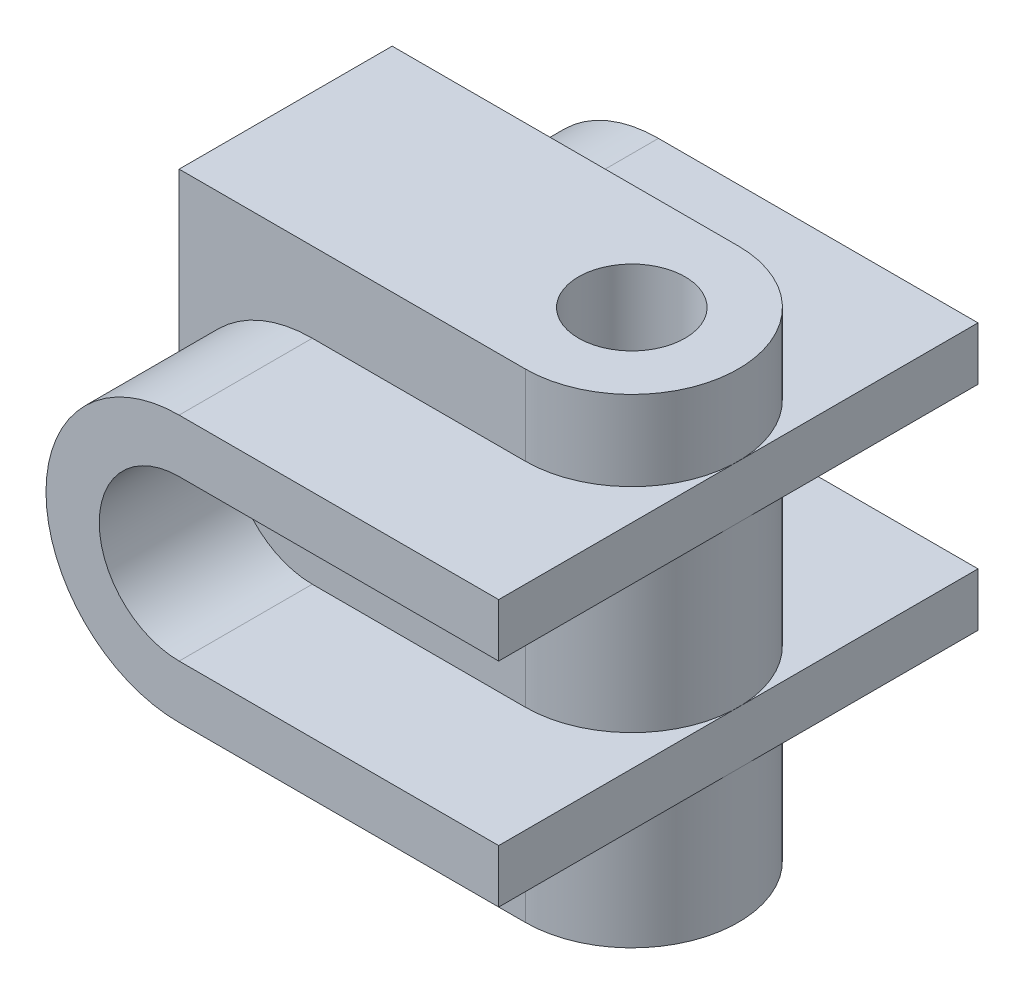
ISO-10303-21;
HEADER;
FILE_DESCRIPTION(('STEP AP214'),'2;1');
FILE_NAME('part.step','',(''),(''),'','','');
FILE_SCHEMA(('AUTOMOTIVE_DESIGN { 1 0 10303 214 1 1 1 1 }'));
ENDSEC;
DATA;
#1=APPLICATION_CONTEXT('core data for automotive mechanical design processes');
#2=APPLICATION_PROTOCOL_DEFINITION('international standard','automotive_design',2000,#1);
#3=PRODUCT_CONTEXT('',#1,'mechanical');
#4=PRODUCT('Part','Part','',(#3));
#5=PRODUCT_RELATED_PRODUCT_CATEGORY('part','',(#4));
#6=PRODUCT_DEFINITION_FORMATION('','',#4);
#7=PRODUCT_DEFINITION_CONTEXT('part definition',#1,'design');
#8=PRODUCT_DEFINITION('design','',#6,#7);
#9=PRODUCT_DEFINITION_SHAPE('','',#8);
#10=(LENGTH_UNIT() NAMED_UNIT(*) SI_UNIT(.MILLI.,.METRE.));
#11=(NAMED_UNIT(*) PLANE_ANGLE_UNIT() SI_UNIT($,.RADIAN.));
#12=(NAMED_UNIT(*) SI_UNIT($,.STERADIAN.) SOLID_ANGLE_UNIT());
#13=UNCERTAINTY_MEASURE_WITH_UNIT(LENGTH_MEASURE(1.E-05),#10,'distance_accuracy_value','');
#14=(GEOMETRIC_REPRESENTATION_CONTEXT(3) GLOBAL_UNCERTAINTY_ASSIGNED_CONTEXT((#13)) GLOBAL_UNIT_ASSIGNED_CONTEXT((#10,
#11,#12)) REPRESENTATION_CONTEXT('',''));
#15=CARTESIAN_POINT('',(0.,0.,0.));
#16=DIRECTION('',(0.,0.,1.));
#17=DIRECTION('',(1.,0.,0.));
#18=AXIS2_PLACEMENT_3D('',#15,#16,#17);
#19=CARTESIAN_POINT('',(-20.,-90.,25.));
#20=DIRECTION('',(0.,0.,-1.));
#21=DIRECTION('',(-1.,0.,0.));
#22=AXIS2_PLACEMENT_3D('',#19,#20,#21);
#23=PLANE('',#22);
#24=DIRECTION('',(-1.,0.,0.));
#25=VECTOR('',#24,1.);
#26=CARTESIAN_POINT('',(-20.,0.,25.));
#27=LINE('',#26,#25);
#28=CARTESIAN_POINT('',(-20.,0.,25.));
#29=VERTEX_POINT('',#28);
#30=CARTESIAN_POINT('',(-85.,0.,25.));
#31=VERTEX_POINT('',#30);
#32=EDGE_CURVE('E84',#29,#31,#27,.T.);
#33=ORIENTED_EDGE('',*,*,#32,.F.);
#34=DIRECTION('',(0.,1.,0.));
#35=VECTOR('',#34,1.);
#36=CARTESIAN_POINT('',(-20.,-90.,25.));
#37=LINE('',#36,#35);
#38=CARTESIAN_POINT('',(-20.,-90.,25.));
#39=VERTEX_POINT('',#38);
#40=EDGE_CURVE('E12',#39,#29,#37,.T.);
#41=ORIENTED_EDGE('',*,*,#40,.F.);
#42=DIRECTION('',(-1.,0.,0.));
#43=VECTOR('',#42,1.);
#44=CARTESIAN_POINT('',(-20.,-90.,25.));
#45=LINE('',#44,#43);
#46=CARTESIAN_POINT('',(-85.,-90.,25.));
#47=VERTEX_POINT('',#46);
#48=EDGE_CURVE('E86',#39,#47,#45,.T.);
#49=ORIENTED_EDGE('',*,*,#48,.T.);
#50=DIRECTION('',(0.,1.,0.));
#51=VECTOR('',#50,1.);
#52=CARTESIAN_POINT('',(-85.,-90.,25.));
#53=LINE('',#52,#51);
#54=EDGE_CURVE('E47',#47,#31,#53,.T.);
#55=ORIENTED_EDGE('',*,*,#54,.T.);
#56=EDGE_LOOP('',(#33,#41,#49,#55));
#57=FACE_BOUND('',#56,.T.);
#58=ADVANCED_FACE('F44',(#57),#23,.T.);
#59=CARTESIAN_POINT('',(-20.,-90.,45.));
#60=DIRECTION('',(0.,1.,0.));
#61=DIRECTION('',(0.,0.,1.));
#62=AXIS2_PLACEMENT_3D('',#59,#60,#61);
#63=CYLINDRICAL_SURFACE('',#62,20.);
#64=CARTESIAN_POINT('',(-20.,0.,45.));
#65=DIRECTION('',(0.,1.,0.));
#66=DIRECTION('',(0.,0.,1.));
#67=AXIS2_PLACEMENT_3D('',#64,#65,#66);
#68=CIRCLE('',#67,20.);
#69=CARTESIAN_POINT('',(-20.,0.,65.));
#70=VERTEX_POINT('',#69);
#71=EDGE_CURVE('E101',#70,#29,#68,.T.);
#72=ORIENTED_EDGE('',*,*,#71,.F.);
#73=DIRECTION('',(0.,1.,0.));
#74=VECTOR('',#73,1.);
#75=CARTESIAN_POINT('',(-20.,-90.,65.));
#76=LINE('',#75,#74);
#77=CARTESIAN_POINT('',(-20.,-90.,65.));
#78=VERTEX_POINT('',#77);
#79=EDGE_CURVE('E52',#78,#70,#76,.T.);
#80=ORIENTED_EDGE('',*,*,#79,.F.);
#81=CARTESIAN_POINT('',(-20.,-90.,45.));
#82=DIRECTION('',(0.,1.,0.));
#83=DIRECTION('',(0.,0.,1.));
#84=AXIS2_PLACEMENT_3D('',#81,#82,#83);
#85=CIRCLE('',#84,20.);
#86=EDGE_CURVE('E91',#78,#39,#85,.T.);
#87=ORIENTED_EDGE('',*,*,#86,.T.);
#88=ORIENTED_EDGE('',*,*,#40,.T.);
#89=EDGE_LOOP('',(#72,#80,#87,#88));
#90=FACE_BOUND('',#89,.T.);
#91=ADVANCED_FACE('F121',(#90),#63,.T.);
#92=CARTESIAN_POINT('',(-85.,-90.,65.));
#93=DIRECTION('',(0.,0.,1.));
#94=DIRECTION('',(1.,0.,0.));
#95=AXIS2_PLACEMENT_3D('',#92,#93,#94);
#96=PLANE('',#95);
#97=DIRECTION('',(1.,0.,0.));
#98=VECTOR('',#97,1.);
#99=CARTESIAN_POINT('',(-85.,0.,65.));
#100=LINE('',#99,#98);
#101=CARTESIAN_POINT('',(-85.,0.,65.));
#102=VERTEX_POINT('',#101);
#103=EDGE_CURVE('E98',#102,#70,#100,.T.);
#104=ORIENTED_EDGE('',*,*,#103,.F.);
#105=DIRECTION('',(0.,1.,0.));
#106=VECTOR('',#105,1.);
#107=CARTESIAN_POINT('',(-85.,-90.,65.));
#108=LINE('',#107,#106);
#109=CARTESIAN_POINT('',(-85.,-90.,65.));
#110=VERTEX_POINT('',#109);
#111=EDGE_CURVE('E90',#110,#102,#108,.T.);
#112=ORIENTED_EDGE('',*,*,#111,.F.);
#113=DIRECTION('',(1.,0.,0.));
#114=VECTOR('',#113,1.);
#115=CARTESIAN_POINT('',(-85.,-90.,65.));
#116=LINE('',#115,#114);
#117=EDGE_CURVE('E114',#110,#78,#116,.T.);
#118=ORIENTED_EDGE('',*,*,#117,.T.);
#119=ORIENTED_EDGE('',*,*,#79,.T.);
#120=EDGE_LOOP('',(#104,#112,#118,#119));
#121=FACE_BOUND('',#120,.T.);
#122=ADVANCED_FACE('F118',(#121),#96,.T.);
#123=CARTESIAN_POINT('',(-85.,-90.,25.));
#124=DIRECTION('',(-1.,0.,0.));
#125=DIRECTION('',(0.,0.,1.));
#126=AXIS2_PLACEMENT_3D('',#123,#124,#125);
#127=PLANE('',#126);
#128=DIRECTION('',(0.,0.,1.));
#129=VECTOR('',#128,1.);
#130=CARTESIAN_POINT('',(-85.,0.,25.));
#131=LINE('',#130,#129);
#132=EDGE_CURVE('E93',#31,#102,#131,.T.);
#133=ORIENTED_EDGE('',*,*,#132,.F.);
#134=ORIENTED_EDGE('',*,*,#54,.F.);
#135=DIRECTION('',(0.,0.,1.));
#136=VECTOR('',#135,1.);
#137=CARTESIAN_POINT('',(-85.,-90.,25.));
#138=LINE('',#137,#136);
#139=EDGE_CURVE('E112',#47,#110,#138,.T.);
#140=ORIENTED_EDGE('',*,*,#139,.T.);
#141=ORIENTED_EDGE('',*,*,#111,.T.);
#142=EDGE_LOOP('',(#133,#134,#140,#141));
#143=FACE_BOUND('',#142,.T.);
#144=ADVANCED_FACE('F94',(#143),#127,.T.);
#145=CARTESIAN_POINT('',(-20.,-90.,45.));
#146=DIRECTION('',(0.,1.,0.));
#147=DIRECTION('',(0.,0.,1.));
#148=AXIS2_PLACEMENT_3D('',#145,#146,#147);
#149=PLANE('',#148);
#150=CARTESIAN_POINT('',(-20.,-90.,45.));
#151=DIRECTION('',(0.,1.,0.));
#152=DIRECTION('',(0.,0.,1.));
#153=AXIS2_PLACEMENT_3D('',#150,#151,#152);
#154=CIRCLE('',#153,10.);
#155=CARTESIAN_POINT('',(-20.,-90.,55.));
#156=VERTEX_POINT('',#155);
#157=EDGE_CURVE('E102',#156,#156,#154,.T.);
#158=ORIENTED_EDGE('',*,*,#157,.T.);
#159=EDGE_LOOP('',(#158));
#160=FACE_BOUND('',#159,.T.);
#161=ORIENTED_EDGE('',*,*,#48,.F.);
#162=ORIENTED_EDGE('',*,*,#86,.F.);
#163=ORIENTED_EDGE('',*,*,#117,.F.);
#164=ORIENTED_EDGE('',*,*,#139,.F.);
#165=EDGE_LOOP('',(#161,#162,#163,#164));
#166=FACE_BOUND('',#165,.T.);
#167=ADVANCED_FACE('F123',(#160,#166),#149,.F.);
#168=CARTESIAN_POINT('',(-20.,0.,45.));
#169=DIRECTION('',(0.,1.,0.));
#170=DIRECTION('',(0.,0.,1.));
#171=AXIS2_PLACEMENT_3D('',#168,#169,#170);
#172=PLANE('',#171);
#173=CARTESIAN_POINT('',(-20.,0.,45.));
#174=DIRECTION('',(0.,1.,0.));
#175=DIRECTION('',(0.,0.,1.));
#176=AXIS2_PLACEMENT_3D('',#173,#174,#175);
#177=CIRCLE('',#176,10.);
#178=CARTESIAN_POINT('',(-20.,0.,55.));
#179=VERTEX_POINT('',#178);
#180=EDGE_CURVE('E105',#179,#179,#177,.T.);
#181=ORIENTED_EDGE('',*,*,#180,.F.);
#182=EDGE_LOOP('',(#181));
#183=FACE_BOUND('',#182,.T.);
#184=ORIENTED_EDGE('',*,*,#32,.T.);
#185=ORIENTED_EDGE('',*,*,#132,.T.);
#186=ORIENTED_EDGE('',*,*,#103,.T.);
#187=ORIENTED_EDGE('',*,*,#71,.T.);
#188=EDGE_LOOP('',(#184,#185,#186,#187));
#189=FACE_BOUND('',#188,.T.);
#190=ADVANCED_FACE('F100',(#183,#189),#172,.T.);
#191=CARTESIAN_POINT('',(-20.,-90.,45.));
#192=DIRECTION('',(0.,1.,0.));
#193=DIRECTION('',(0.,0.,1.));
#194=AXIS2_PLACEMENT_3D('',#191,#192,#193);
#195=CYLINDRICAL_SURFACE('',#194,10.);
#196=CARTESIAN_POINT('',(-20.,-90.,55.));
#197=CARTESIAN_POINT('',(-20.,-89.0625,55.));
#198=CARTESIAN_POINT('',(-20.,-88.125,55.));
#199=CARTESIAN_POINT('',(-20.,-86.25,55.));
#200=CARTESIAN_POINT('',(-20.,-85.3125,55.));
#201=CARTESIAN_POINT('',(-20.,-83.4375,55.));
#202=CARTESIAN_POINT('',(-20.,-82.5,55.));
#203=CARTESIAN_POINT('',(-20.,-80.625,55.));
#204=CARTESIAN_POINT('',(-20.,-79.6875,55.));
#205=CARTESIAN_POINT('',(-20.,-77.8125,55.));
#206=CARTESIAN_POINT('',(-20.,-76.875,55.));
#207=CARTESIAN_POINT('',(-20.,-75.,55.));
#208=CARTESIAN_POINT('',(-20.,-74.0625,55.));
#209=CARTESIAN_POINT('',(-20.,-72.1875,55.));
#210=CARTESIAN_POINT('',(-20.,-71.25,55.));
#211=CARTESIAN_POINT('',(-20.,-69.375,55.));
#212=CARTESIAN_POINT('',(-20.,-68.4375,55.));
#213=CARTESIAN_POINT('',(-20.,-66.5625,55.));
#214=CARTESIAN_POINT('',(-20.,-65.625,55.));
#215=CARTESIAN_POINT('',(-20.,-63.75,55.));
#216=CARTESIAN_POINT('',(-20.,-62.8125,55.));
#217=CARTESIAN_POINT('',(-20.,-60.9375,55.));
#218=CARTESIAN_POINT('',(-20.,-60.,55.));
#219=CARTESIAN_POINT('',(-20.,-58.125,55.));
#220=CARTESIAN_POINT('',(-20.,-57.1875,55.));
#221=CARTESIAN_POINT('',(-20.,-55.3125,55.));
#222=CARTESIAN_POINT('',(-20.,-54.375,55.));
#223=CARTESIAN_POINT('',(-20.,-52.5,55.));
#224=CARTESIAN_POINT('',(-20.,-51.5625,55.));
#225=CARTESIAN_POINT('',(-20.,-49.6875,55.));
#226=CARTESIAN_POINT('',(-20.,-48.75,55.));
#227=CARTESIAN_POINT('',(-20.,-46.875,55.));
#228=CARTESIAN_POINT('',(-20.,-45.9375,55.));
#229=CARTESIAN_POINT('',(-20.,-44.0625,55.));
#230=CARTESIAN_POINT('',(-20.,-43.125,55.));
#231=CARTESIAN_POINT('',(-20.,-41.25,55.));
#232=CARTESIAN_POINT('',(-20.,-40.3125,55.));
#233=CARTESIAN_POINT('',(-20.,-38.4375,55.));
#234=CARTESIAN_POINT('',(-20.,-37.5,55.));
#235=CARTESIAN_POINT('',(-20.,-35.625,55.));
#236=CARTESIAN_POINT('',(-20.,-34.6875,55.));
#237=CARTESIAN_POINT('',(-20.,-32.8125,55.));
#238=CARTESIAN_POINT('',(-20.,-31.875,55.));
#239=CARTESIAN_POINT('',(-20.,-30.,55.));
#240=CARTESIAN_POINT('',(-20.,-29.0625,55.));
#241=CARTESIAN_POINT('',(-20.,-27.1875,55.));
#242=CARTESIAN_POINT('',(-20.,-26.25,55.));
#243=CARTESIAN_POINT('',(-20.,-24.375,55.));
#244=CARTESIAN_POINT('',(-20.,-23.4375,55.));
#245=CARTESIAN_POINT('',(-20.,-21.5625,55.));
#246=CARTESIAN_POINT('',(-20.,-20.625,55.));
#247=CARTESIAN_POINT('',(-20.,-18.75,55.));
#248=CARTESIAN_POINT('',(-20.,-17.8125,55.));
#249=CARTESIAN_POINT('',(-20.,-15.9375,55.));
#250=CARTESIAN_POINT('',(-20.,-15.,55.));
#251=CARTESIAN_POINT('',(-20.,-13.125,55.));
#252=CARTESIAN_POINT('',(-20.,-12.1875,55.));
#253=CARTESIAN_POINT('',(-20.,-10.3125,55.));
#254=CARTESIAN_POINT('',(-20.,-9.37500000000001,55.));
#255=CARTESIAN_POINT('',(-20.,-7.50000000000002,55.));
#256=CARTESIAN_POINT('',(-20.,-6.56250000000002,55.));
#257=CARTESIAN_POINT('',(-20.,-4.68750000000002,55.));
#258=CARTESIAN_POINT('',(-20.,-3.75000000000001,55.));
#259=CARTESIAN_POINT('',(-20.,-1.87500000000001,55.));
#260=CARTESIAN_POINT('',(-20.,-0.937500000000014,55.));
#261=CARTESIAN_POINT('',(-20.,0.,55.));
#262=B_SPLINE_CURVE_WITH_KNOTS('',3,(#196,#197,#198,#199,#200,#201,#202,#203,#204,#205,#206,
#207,#208,#209,#210,#211,#212,#213,#214,#215,#216,#217,#218,#219,#220,#221,#222,#223,#224,#225,
#226,#227,#228,#229,#230,#231,#232,#233,#234,#235,#236,#237,#238,#239,#240,#241,#242,#243,#244,
#245,#246,#247,#248,#249,#250,#251,#252,#253,#254,#255,#256,#257,#258,#259,#260,#261),
.UNSPECIFIED.,.F.,.F.,(4,2,2,2,2,2,2,2,2,2,2,2,2,2,2,2,2,2,2,2,2,2,2,2,2,2,2,2,2,2,2,2,4),(0.,
2.81250000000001,5.62500000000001,8.4375,11.25,14.0625,16.875,19.6875,22.5,25.3125,28.125,
30.9375,33.75,36.5625,39.375,42.1875,45.,47.8125,50.625,53.4375,56.25,59.0625,61.875,64.6875,
67.5,70.3125,73.125,75.9375,78.75,81.5625,84.375,87.1875,90.),.UNSPECIFIED.);
#263=EDGE_CURVE('BSEAM131',#156,#179,#262,.T.);
#264=ORIENTED_EDGE('',*,*,#157,.F.);
#265=ORIENTED_EDGE('',*,*,#180,.T.);
#266=ORIENTED_EDGE('',*,*,#263,.T.);
#267=ORIENTED_EDGE('',*,*,#263,.F.);
#268=EDGE_LOOP('',(#264,#266,#265,#267));
#269=FACE_BOUND('',#268,.T.);
#270=ADVANCED_FACE('F131',(#269),#195,.F.);
#271=CLOSED_SHELL('',(#58,#91,#122,#144,#167,#190,#270));
#272=MANIFOLD_SOLID_BREP('B2',#271);
#273=CARTESIAN_POINT('',(-60.,-65.,90.));
#274=DIRECTION('',(0.,1.,0.));
#275=DIRECTION('',(-1.,0.,0.));
#276=AXIS2_PLACEMENT_3D('',#273,#274,#275);
#277=PLANE('',#276);
#278=DIRECTION('',(1.,0.,0.));
#279=VECTOR('',#278,1.);
#280=CARTESIAN_POINT('',(-60.,-65.,0.));
#281=LINE('',#280,#279);
#282=CARTESIAN_POINT('',(-60.,-65.,0.));
#283=VERTEX_POINT('',#282);
#284=CARTESIAN_POINT('',(0.,-65.,0.));
#285=VERTEX_POINT('',#284);
#286=EDGE_CURVE('E269',#283,#285,#281,.T.);
#287=ORIENTED_EDGE('',*,*,#286,.T.);
#288=DIRECTION('',(0.,0.,-1.));
#289=VECTOR('',#288,1.);
#290=CARTESIAN_POINT('',(0.,-65.,90.));
#291=LINE('',#290,#289);
#292=CARTESIAN_POINT('',(0.,-65.,90.));
#293=VERTEX_POINT('',#292);
#294=EDGE_CURVE('E42',#293,#285,#291,.T.);
#295=ORIENTED_EDGE('',*,*,#294,.F.);
#296=DIRECTION('',(1.,0.,0.));
#297=VECTOR('',#296,1.);
#298=CARTESIAN_POINT('',(-60.,-65.,90.));
#299=LINE('',#298,#297);
#300=CARTESIAN_POINT('',(-60.,-65.,90.));
#301=VERTEX_POINT('',#300);
#302=EDGE_CURVE('E293',#301,#293,#299,.T.);
#303=ORIENTED_EDGE('',*,*,#302,.F.);
#304=DIRECTION('',(0.,0.,-1.));
#305=VECTOR('',#304,1.);
#306=CARTESIAN_POINT('',(-60.,-65.,90.));
#307=LINE('',#306,#305);
#308=EDGE_CURVE('E270',#301,#283,#307,.T.);
#309=ORIENTED_EDGE('',*,*,#308,.T.);
#310=EDGE_LOOP('',(#287,#295,#303,#309));
#311=FACE_BOUND('',#310,.T.);
#312=ADVANCED_FACE('F194',(#311),#277,.F.);
#313=CARTESIAN_POINT('',(0.,-55.,90.));
#314=DIRECTION('',(1.,0.,0.));
#315=DIRECTION('',(0.,1.,0.));
#316=AXIS2_PLACEMENT_3D('',#313,#314,#315);
#317=PLANE('',#316);
#318=DIRECTION('',(0.,-1.,0.));
#319=VECTOR('',#318,1.);
#320=CARTESIAN_POINT('',(0.,-55.,0.));
#321=LINE('',#320,#319);
#322=CARTESIAN_POINT('',(0.,-55.,0.));
#323=VERTEX_POINT('',#322);
#324=EDGE_CURVE('E261',#323,#285,#321,.T.);
#325=ORIENTED_EDGE('',*,*,#324,.F.);
#326=DIRECTION('',(0.,0.,-1.));
#327=VECTOR('',#326,1.);
#328=CARTESIAN_POINT('',(0.,-55.,90.));
#329=LINE('',#328,#327);
#330=CARTESIAN_POINT('',(0.,-55.,90.));
#331=VERTEX_POINT('',#330);
#332=EDGE_CURVE('E201',#331,#323,#329,.T.);
#333=ORIENTED_EDGE('',*,*,#332,.F.);
#334=DIRECTION('',(0.,-1.,0.));
#335=VECTOR('',#334,1.);
#336=CARTESIAN_POINT('',(0.,-55.,90.));
#337=LINE('',#336,#335);
#338=EDGE_CURVE('E264',#331,#293,#337,.T.);
#339=ORIENTED_EDGE('',*,*,#338,.T.);
#340=ORIENTED_EDGE('',*,*,#294,.T.);
#341=EDGE_LOOP('',(#325,#333,#339,#340));
#342=FACE_BOUND('',#341,.T.);
#343=ADVANCED_FACE('F259',(#342),#317,.T.);
#344=CARTESIAN_POINT('',(-60.,-55.,90.));
#345=DIRECTION('',(0.,1.,0.));
#346=DIRECTION('',(-1.,0.,0.));
#347=AXIS2_PLACEMENT_3D('',#344,#345,#346);
#348=PLANE('',#347);
#349=DIRECTION('',(1.,0.,0.));
#350=VECTOR('',#349,1.);
#351=CARTESIAN_POINT('',(-60.,-55.,0.));
#352=LINE('',#351,#350);
#353=CARTESIAN_POINT('',(-60.,-55.,0.));
#354=VERTEX_POINT('',#353);
#355=EDGE_CURVE('E277',#354,#323,#352,.T.);
#356=ORIENTED_EDGE('',*,*,#355,.F.);
#357=DIRECTION('',(0.,0.,-1.));
#358=VECTOR('',#357,1.);
#359=CARTESIAN_POINT('',(-60.,-55.,90.));
#360=LINE('',#359,#358);
#361=CARTESIAN_POINT('',(-60.,-55.,90.));
#362=VERTEX_POINT('',#361);
#363=EDGE_CURVE('E320',#362,#354,#360,.T.);
#364=ORIENTED_EDGE('',*,*,#363,.F.);
#365=DIRECTION('',(1.,0.,0.));
#366=VECTOR('',#365,1.);
#367=CARTESIAN_POINT('',(-60.,-55.,90.));
#368=LINE('',#367,#366);
#369=EDGE_CURVE('E296',#362,#331,#368,.T.);
#370=ORIENTED_EDGE('',*,*,#369,.T.);
#371=ORIENTED_EDGE('',*,*,#332,.T.);
#372=EDGE_LOOP('',(#356,#364,#370,#371));
#373=FACE_BOUND('',#372,.T.);
#374=ADVANCED_FACE('F322',(#373),#348,.T.);
#375=CARTESIAN_POINT('',(-60.,-40.,90.));
#376=DIRECTION('',(0.,0.,-1.));
#377=DIRECTION('',(-1.,0.,0.));
#378=AXIS2_PLACEMENT_3D('',#375,#376,#377);
#379=CYLINDRICAL_SURFACE('',#378,15.);
#380=CARTESIAN_POINT('',(-60.,-40.,0.));
#381=DIRECTION('',(0.,0.,1.));
#382=DIRECTION('',(1.,0.,0.));
#383=AXIS2_PLACEMENT_3D('',#380,#381,#382);
#384=CIRCLE('',#383,15.);
#385=CARTESIAN_POINT('',(-60.,-25.,0.));
#386=VERTEX_POINT('',#385);
#387=EDGE_CURVE('E279',#386,#354,#384,.T.);
#388=ORIENTED_EDGE('',*,*,#387,.F.);
#389=DIRECTION('',(0.,0.,-1.));
#390=VECTOR('',#389,1.);
#391=CARTESIAN_POINT('',(-60.,-25.,90.));
#392=LINE('',#391,#390);
#393=CARTESIAN_POINT('',(-60.,-25.,90.));
#394=VERTEX_POINT('',#393);
#395=EDGE_CURVE('E318',#394,#386,#392,.T.);
#396=ORIENTED_EDGE('',*,*,#395,.F.);
#397=CARTESIAN_POINT('',(-60.,-40.,90.));
#398=DIRECTION('',(0.,0.,1.));
#399=DIRECTION('',(1.,0.,0.));
#400=AXIS2_PLACEMENT_3D('',#397,#398,#399);
#401=CIRCLE('',#400,15.);
#402=EDGE_CURVE('E299',#394,#362,#401,.T.);
#403=ORIENTED_EDGE('',*,*,#402,.T.);
#404=ORIENTED_EDGE('',*,*,#363,.T.);
#405=EDGE_LOOP('',(#388,#396,#403,#404));
#406=FACE_BOUND('',#405,.T.);
#407=ADVANCED_FACE('F329',(#406),#379,.F.);
#408=CARTESIAN_POINT('',(0.,-25.,90.));
#409=DIRECTION('',(0.,-1.,0.));
#410=DIRECTION('',(1.,0.,0.));
#411=AXIS2_PLACEMENT_3D('',#408,#409,#410);
#412=PLANE('',#411);
#413=DIRECTION('',(-1.,0.,0.));
#414=VECTOR('',#413,1.);
#415=CARTESIAN_POINT('',(0.,-25.,0.));
#416=LINE('',#415,#414);
#417=CARTESIAN_POINT('',(0.,-25.,0.));
#418=VERTEX_POINT('',#417);
#419=EDGE_CURVE('E283',#418,#386,#416,.T.);
#420=ORIENTED_EDGE('',*,*,#419,.F.);
#421=DIRECTION('',(0.,0.,-1.));
#422=VECTOR('',#421,1.);
#423=CARTESIAN_POINT('',(0.,-25.,90.));
#424=LINE('',#423,#422);
#425=CARTESIAN_POINT('',(0.,-25.,90.));
#426=VERTEX_POINT('',#425);
#427=EDGE_CURVE('E316',#426,#418,#424,.T.);
#428=ORIENTED_EDGE('',*,*,#427,.F.);
#429=DIRECTION('',(-1.,0.,0.));
#430=VECTOR('',#429,1.);
#431=CARTESIAN_POINT('',(0.,-25.,90.));
#432=LINE('',#431,#430);
#433=EDGE_CURVE('E302',#426,#394,#432,.T.);
#434=ORIENTED_EDGE('',*,*,#433,.T.);
#435=ORIENTED_EDGE('',*,*,#395,.T.);
#436=EDGE_LOOP('',(#420,#428,#434,#435));
#437=FACE_BOUND('',#436,.T.);
#438=ADVANCED_FACE('F332',(#437),#412,.T.);
#439=CARTESIAN_POINT('',(0.,-15.,90.));
#440=DIRECTION('',(1.,0.,0.));
#441=DIRECTION('',(0.,1.,0.));
#442=AXIS2_PLACEMENT_3D('',#439,#440,#441);
#443=PLANE('',#442);
#444=DIRECTION('',(0.,-1.,0.));
#445=VECTOR('',#444,1.);
#446=CARTESIAN_POINT('',(0.,-15.,0.));
#447=LINE('',#446,#445);
#448=CARTESIAN_POINT('',(0.,-15.,0.));
#449=VERTEX_POINT('',#448);
#450=EDGE_CURVE('E286',#449,#418,#447,.T.);
#451=ORIENTED_EDGE('',*,*,#450,.F.);
#452=DIRECTION('',(0.,0.,-1.));
#453=VECTOR('',#452,1.);
#454=CARTESIAN_POINT('',(0.,-15.,90.));
#455=LINE('',#454,#453);
#456=CARTESIAN_POINT('',(0.,-15.,90.));
#457=VERTEX_POINT('',#456);
#458=EDGE_CURVE('E314',#457,#449,#455,.T.);
#459=ORIENTED_EDGE('',*,*,#458,.F.);
#460=DIRECTION('',(0.,-1.,0.));
#461=VECTOR('',#460,1.);
#462=CARTESIAN_POINT('',(0.,-15.,90.));
#463=LINE('',#462,#461);
#464=EDGE_CURVE('E305',#457,#426,#463,.T.);
#465=ORIENTED_EDGE('',*,*,#464,.T.);
#466=ORIENTED_EDGE('',*,*,#427,.T.);
#467=EDGE_LOOP('',(#451,#459,#465,#466));
#468=FACE_BOUND('',#467,.T.);
#469=ADVANCED_FACE('F335',(#468),#443,.T.);
#470=CARTESIAN_POINT('',(0.,-15.,90.));
#471=DIRECTION('',(0.,-1.,0.));
#472=DIRECTION('',(1.,0.,0.));
#473=AXIS2_PLACEMENT_3D('',#470,#471,#472);
#474=PLANE('',#473);
#475=DIRECTION('',(-1.,0.,0.));
#476=VECTOR('',#475,1.);
#477=CARTESIAN_POINT('',(0.,-15.,0.));
#478=LINE('',#477,#476);
#479=CARTESIAN_POINT('',(-60.,-15.,0.));
#480=VERTEX_POINT('',#479);
#481=EDGE_CURVE('E289',#449,#480,#478,.T.);
#482=ORIENTED_EDGE('',*,*,#481,.T.);
#483=DIRECTION('',(0.,0.,-1.));
#484=VECTOR('',#483,1.);
#485=CARTESIAN_POINT('',(-60.,-15.,90.));
#486=LINE('',#485,#484);
#487=CARTESIAN_POINT('',(-60.,-15.,90.));
#488=VERTEX_POINT('',#487);
#489=EDGE_CURVE('E311',#488,#480,#486,.T.);
#490=ORIENTED_EDGE('',*,*,#489,.F.);
#491=DIRECTION('',(-1.,0.,0.));
#492=VECTOR('',#491,1.);
#493=CARTESIAN_POINT('',(0.,-15.,90.));
#494=LINE('',#493,#492);
#495=EDGE_CURVE('E213',#457,#488,#494,.T.);
#496=ORIENTED_EDGE('',*,*,#495,.F.);
#497=ORIENTED_EDGE('',*,*,#458,.T.);
#498=EDGE_LOOP('',(#482,#490,#496,#497));
#499=FACE_BOUND('',#498,.T.);
#500=ADVANCED_FACE('F338',(#499),#474,.F.);
#501=CARTESIAN_POINT('',(-60.,-40.,90.));
#502=DIRECTION('',(0.,0.,-1.));
#503=DIRECTION('',(-1.,0.,0.));
#504=AXIS2_PLACEMENT_3D('',#501,#502,#503);
#505=CYLINDRICAL_SURFACE('',#504,25.);
#506=CARTESIAN_POINT('',(-60.,-40.,0.));
#507=DIRECTION('',(0.,0.,1.));
#508=DIRECTION('',(1.,0.,0.));
#509=AXIS2_PLACEMENT_3D('',#506,#507,#508);
#510=CIRCLE('',#509,25.);
#511=EDGE_CURVE('E291',#480,#283,#510,.T.);
#512=ORIENTED_EDGE('',*,*,#511,.T.);
#513=ORIENTED_EDGE('',*,*,#308,.F.);
#514=CARTESIAN_POINT('',(-60.,-40.,90.));
#515=DIRECTION('',(0.,0.,1.));
#516=DIRECTION('',(1.,0.,0.));
#517=AXIS2_PLACEMENT_3D('',#514,#515,#516);
#518=CIRCLE('',#517,25.);
#519=EDGE_CURVE('E208',#488,#301,#518,.T.);
#520=ORIENTED_EDGE('',*,*,#519,.F.);
#521=ORIENTED_EDGE('',*,*,#489,.T.);
#522=EDGE_LOOP('',(#512,#513,#520,#521));
#523=FACE_BOUND('',#522,.T.);
#524=ADVANCED_FACE('F340',(#523),#505,.T.);
#525=CARTESIAN_POINT('',(-60.,-40.,90.));
#526=DIRECTION('',(0.,0.,1.));
#527=DIRECTION('',(1.,0.,0.));
#528=AXIS2_PLACEMENT_3D('',#525,#526,#527);
#529=PLANE('',#528);
#530=ORIENTED_EDGE('',*,*,#302,.T.);
#531=ORIENTED_EDGE('',*,*,#338,.F.);
#532=ORIENTED_EDGE('',*,*,#369,.F.);
#533=ORIENTED_EDGE('',*,*,#402,.F.);
#534=ORIENTED_EDGE('',*,*,#433,.F.);
#535=ORIENTED_EDGE('',*,*,#464,.F.);
#536=ORIENTED_EDGE('',*,*,#495,.T.);
#537=ORIENTED_EDGE('',*,*,#519,.T.);
#538=EDGE_LOOP('',(#530,#531,#532,#533,#534,#535,#536,#537));
#539=FACE_BOUND('',#538,.T.);
#540=ADVANCED_FACE('F324',(#539),#529,.T.);
#541=CARTESIAN_POINT('',(-60.,-40.,0.));
#542=DIRECTION('',(0.,0.,1.));
#543=DIRECTION('',(1.,0.,0.));
#544=AXIS2_PLACEMENT_3D('',#541,#542,#543);
#545=PLANE('',#544);
#546=ORIENTED_EDGE('',*,*,#286,.F.);
#547=ORIENTED_EDGE('',*,*,#511,.F.);
#548=ORIENTED_EDGE('',*,*,#481,.F.);
#549=ORIENTED_EDGE('',*,*,#450,.T.);
#550=ORIENTED_EDGE('',*,*,#419,.T.);
#551=ORIENTED_EDGE('',*,*,#387,.T.);
#552=ORIENTED_EDGE('',*,*,#355,.T.);
#553=ORIENTED_EDGE('',*,*,#324,.T.);
#554=EDGE_LOOP('',(#546,#547,#548,#549,#550,#551,#552,#553));
#555=FACE_BOUND('',#554,.T.);
#556=ADVANCED_FACE('F274',(#555),#545,.F.);
#557=CLOSED_SHELL('',(#312,#343,#374,#407,#438,#469,#500,#524,#540,#556));
#558=MANIFOLD_SOLID_BREP('B6',#557);
#559=ADVANCED_BREP_SHAPE_REPRESENTATION('',(#18,#272,#558),#14);
#560=SHAPE_DEFINITION_REPRESENTATION(#9,#559);
ENDSEC;
END-ISO-10303-21;
